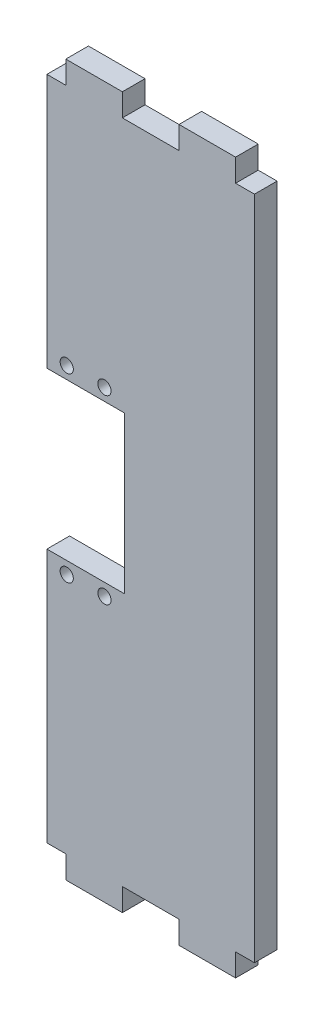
ISO-10303-21;
HEADER;
FILE_DESCRIPTION(('STEP AP214'),'2;1');
FILE_NAME('part.step','',(''),(''),'','','');
FILE_SCHEMA(('AUTOMOTIVE_DESIGN { 1 0 10303 214 1 1 1 1 }'));
ENDSEC;
DATA;
#1=APPLICATION_CONTEXT('core data for automotive mechanical design processes');
#2=APPLICATION_PROTOCOL_DEFINITION('international standard','automotive_design',2000,#1);
#3=PRODUCT_CONTEXT('',#1,'mechanical');
#4=PRODUCT('Part','Part','',(#3));
#5=PRODUCT_RELATED_PRODUCT_CATEGORY('part','',(#4));
#6=PRODUCT_DEFINITION_FORMATION('','',#4);
#7=PRODUCT_DEFINITION_CONTEXT('part definition',#1,'design');
#8=PRODUCT_DEFINITION('design','',#6,#7);
#9=PRODUCT_DEFINITION_SHAPE('','',#8);
#10=(LENGTH_UNIT() NAMED_UNIT(*) SI_UNIT(.MILLI.,.METRE.));
#11=(NAMED_UNIT(*) PLANE_ANGLE_UNIT() SI_UNIT($,.RADIAN.));
#12=(NAMED_UNIT(*) SI_UNIT($,.STERADIAN.) SOLID_ANGLE_UNIT());
#13=UNCERTAINTY_MEASURE_WITH_UNIT(LENGTH_MEASURE(1.E-05),#10,'distance_accuracy_value','');
#14=(GEOMETRIC_REPRESENTATION_CONTEXT(3) GLOBAL_UNCERTAINTY_ASSIGNED_CONTEXT((#13)) GLOBAL_UNIT_ASSIGNED_CONTEXT((#10,
#11,#12)) REPRESENTATION_CONTEXT('',''));
#15=CARTESIAN_POINT('',(0.,0.,0.));
#16=DIRECTION('',(0.,0.,1.));
#17=DIRECTION('',(1.,0.,0.));
#18=AXIS2_PLACEMENT_3D('',#15,#16,#17);
#19=CARTESIAN_POINT('',(-27.5,-88.2,6.));
#20=DIRECTION('',(1.,0.,0.));
#21=DIRECTION('',(0.,0.,-1.));
#22=AXIS2_PLACEMENT_3D('',#19,#20,#21);
#23=PLANE('',#22);
#24=DIRECTION('',(0.,-1.,0.));
#25=VECTOR('',#24,1.);
#26=CARTESIAN_POINT('',(-27.5,-88.2,0.));
#27=LINE('',#26,#25);
#28=CARTESIAN_POINT('',(-27.5,88.2,0.));
#29=VERTEX_POINT('',#28);
#30=CARTESIAN_POINT('',(-27.5,20.75,0.));
#31=VERTEX_POINT('',#30);
#32=EDGE_CURVE('E221',#29,#31,#27,.T.);
#33=ORIENTED_EDGE('',*,*,#32,.T.);
#34=DIRECTION('',(0.,0.,1.));
#35=VECTOR('',#34,1.);
#36=CARTESIAN_POINT('',(-27.5,20.75,0.));
#37=LINE('',#36,#35);
#38=CARTESIAN_POINT('',(-27.5,20.75,6.));
#39=VERTEX_POINT('',#38);
#40=EDGE_CURVE('E261',#31,#39,#37,.T.);
#41=ORIENTED_EDGE('',*,*,#40,.T.);
#42=DIRECTION('',(0.,-1.,0.));
#43=VECTOR('',#42,1.);
#44=CARTESIAN_POINT('',(-27.5,-88.2,6.));
#45=LINE('',#44,#43);
#46=CARTESIAN_POINT('',(-27.5,88.2,6.));
#47=VERTEX_POINT('',#46);
#48=EDGE_CURVE('E246',#47,#39,#45,.T.);
#49=ORIENTED_EDGE('',*,*,#48,.F.);
#50=DIRECTION('',(0.,0.,-1.));
#51=VECTOR('',#50,1.);
#52=CARTESIAN_POINT('',(-27.5,88.2,6.));
#53=LINE('',#52,#51);
#54=EDGE_CURVE('E43',#47,#29,#53,.T.);
#55=ORIENTED_EDGE('',*,*,#54,.T.);
#56=EDGE_LOOP('',(#33,#41,#49,#55));
#57=FACE_BOUND('',#56,.T.);
#58=ADVANCED_FACE('F35',(#57),#23,.F.);
#59=CARTESIAN_POINT('',(-27.5,88.2,6.));
#60=DIRECTION('',(0.,-1.,0.));
#61=DIRECTION('',(0.,0.,-1.));
#62=AXIS2_PLACEMENT_3D('',#59,#60,#61);
#63=PLANE('',#62);
#64=DIRECTION('',(-1.,0.,0.));
#65=VECTOR('',#64,1.);
#66=CARTESIAN_POINT('',(-27.5,88.2,6.));
#67=LINE('',#66,#65);
#68=CARTESIAN_POINT('',(7.5,88.2,6.));
#69=VERTEX_POINT('',#68);
#70=CARTESIAN_POINT('',(-7.5,88.2,6.));
#71=VERTEX_POINT('',#70);
#72=EDGE_CURVE('E372',#69,#71,#67,.T.);
#73=ORIENTED_EDGE('',*,*,#72,.F.);
#74=DIRECTION('',(0.,0.,-1.));
#75=VECTOR('',#74,1.);
#76=CARTESIAN_POINT('',(7.5,88.2,6.));
#77=LINE('',#76,#75);
#78=CARTESIAN_POINT('',(7.5,88.2,0.));
#79=VERTEX_POINT('',#78);
#80=EDGE_CURVE('E312',#69,#79,#77,.T.);
#81=ORIENTED_EDGE('',*,*,#80,.T.);
#82=DIRECTION('',(-1.,0.,0.));
#83=VECTOR('',#82,1.);
#84=CARTESIAN_POINT('',(-27.5,88.2,0.));
#85=LINE('',#84,#83);
#86=CARTESIAN_POINT('',(-7.5,88.2,0.));
#87=VERTEX_POINT('',#86);
#88=EDGE_CURVE('E226',#79,#87,#85,.T.);
#89=ORIENTED_EDGE('',*,*,#88,.T.);
#90=DIRECTION('',(0.,0.,1.));
#91=VECTOR('',#90,1.);
#92=CARTESIAN_POINT('',(-7.5,88.2,6.));
#93=LINE('',#92,#91);
#94=EDGE_CURVE('E358',#87,#71,#93,.T.);
#95=ORIENTED_EDGE('',*,*,#94,.T.);
#96=EDGE_LOOP('',(#73,#81,#89,#95));
#97=FACE_BOUND('',#96,.T.);
#98=ADVANCED_FACE('F382',(#97),#63,.F.);
#99=CARTESIAN_POINT('',(-27.5,-88.2,6.));
#100=DIRECTION('',(0.,1.,0.));
#101=DIRECTION('',(0.,0.,1.));
#102=AXIS2_PLACEMENT_3D('',#99,#100,#101);
#103=PLANE('',#102);
#104=DIRECTION('',(1.,0.,0.));
#105=VECTOR('',#104,1.);
#106=CARTESIAN_POINT('',(-27.5,-88.2,0.));
#107=LINE('',#106,#105);
#108=CARTESIAN_POINT('',(-7.5,-88.2,0.));
#109=VERTEX_POINT('',#108);
#110=CARTESIAN_POINT('',(7.5,-88.2,0.));
#111=VERTEX_POINT('',#110);
#112=EDGE_CURVE('E233',#109,#111,#107,.T.);
#113=ORIENTED_EDGE('',*,*,#112,.T.);
#114=DIRECTION('',(0.,0.,1.));
#115=VECTOR('',#114,1.);
#116=CARTESIAN_POINT('',(7.5,-88.2,6.));
#117=LINE('',#116,#115);
#118=CARTESIAN_POINT('',(7.5,-88.2,6.));
#119=VERTEX_POINT('',#118);
#120=EDGE_CURVE('E310',#111,#119,#117,.T.);
#121=ORIENTED_EDGE('',*,*,#120,.T.);
#122=DIRECTION('',(1.,0.,0.));
#123=VECTOR('',#122,1.);
#124=CARTESIAN_POINT('',(-27.5,-88.2,6.));
#125=LINE('',#124,#123);
#126=CARTESIAN_POINT('',(-7.5,-88.2,6.));
#127=VERTEX_POINT('',#126);
#128=EDGE_CURVE('E375',#127,#119,#125,.T.);
#129=ORIENTED_EDGE('',*,*,#128,.F.);
#130=DIRECTION('',(0.,0.,-1.));
#131=VECTOR('',#130,1.);
#132=CARTESIAN_POINT('',(-7.5,-88.2,6.));
#133=LINE('',#132,#131);
#134=EDGE_CURVE('E343',#127,#109,#133,.T.);
#135=ORIENTED_EDGE('',*,*,#134,.T.);
#136=EDGE_LOOP('',(#113,#121,#129,#135));
#137=FACE_BOUND('',#136,.T.);
#138=ADVANCED_FACE('F417',(#137),#103,.F.);
#139=CARTESIAN_POINT('',(-22.5,88.2,6.));
#140=VERTEX_POINT('',#139);
#141=EDGE_CURVE('E368',#140,#47,#67,.T.);
#142=ORIENTED_EDGE('',*,*,#141,.F.);
#143=DIRECTION('',(0.,0.,-1.));
#144=VECTOR('',#143,1.);
#145=CARTESIAN_POINT('',(-22.5,88.2,6.));
#146=LINE('',#145,#144);
#147=CARTESIAN_POINT('',(-22.5,88.2,0.));
#148=VERTEX_POINT('',#147);
#149=EDGE_CURVE('E363',#140,#148,#146,.T.);
#150=ORIENTED_EDGE('',*,*,#149,.T.);
#151=EDGE_CURVE('E228',#148,#29,#85,.T.);
#152=ORIENTED_EDGE('',*,*,#151,.T.);
#153=ORIENTED_EDGE('',*,*,#54,.F.);
#154=EDGE_LOOP('',(#142,#150,#152,#153));
#155=FACE_BOUND('',#154,.T.);
#156=ADVANCED_FACE('F467',(#155),#63,.F.);
#157=CARTESIAN_POINT('',(-27.5,-88.2,0.));
#158=VERTEX_POINT('',#157);
#159=CARTESIAN_POINT('',(-22.5,-88.2,0.));
#160=VERTEX_POINT('',#159);
#161=EDGE_CURVE('E220',#158,#160,#107,.T.);
#162=ORIENTED_EDGE('',*,*,#161,.T.);
#163=DIRECTION('',(0.,0.,1.));
#164=VECTOR('',#163,1.);
#165=CARTESIAN_POINT('',(-22.5,-88.2,6.));
#166=LINE('',#165,#164);
#167=CARTESIAN_POINT('',(-22.5,-88.2,6.));
#168=VERTEX_POINT('',#167);
#169=EDGE_CURVE('E361',#160,#168,#166,.T.);
#170=ORIENTED_EDGE('',*,*,#169,.T.);
#171=CARTESIAN_POINT('',(-27.5,-88.2,6.));
#172=VERTEX_POINT('',#171);
#173=EDGE_CURVE('E238',#172,#168,#125,.T.);
#174=ORIENTED_EDGE('',*,*,#173,.F.);
#175=DIRECTION('',(0.,0.,-1.));
#176=VECTOR('',#175,1.);
#177=CARTESIAN_POINT('',(-27.5,-88.2,6.));
#178=LINE('',#177,#176);
#179=EDGE_CURVE('E237',#172,#158,#178,.T.);
#180=ORIENTED_EDGE('',*,*,#179,.T.);
#181=EDGE_LOOP('',(#162,#170,#174,#180));
#182=FACE_BOUND('',#181,.T.);
#183=ADVANCED_FACE('F445',(#182),#103,.F.);
#184=CARTESIAN_POINT('',(27.5,-88.2,6.));
#185=DIRECTION('',(-1.,0.,0.));
#186=DIRECTION('',(0.,0.,1.));
#187=AXIS2_PLACEMENT_3D('',#184,#185,#186);
#188=PLANE('',#187);
#189=DIRECTION('',(0.,1.,0.));
#190=VECTOR('',#189,1.);
#191=CARTESIAN_POINT('',(27.5,-88.2,0.));
#192=LINE('',#191,#190);
#193=CARTESIAN_POINT('',(27.5,-88.2,0.));
#194=VERTEX_POINT('',#193);
#195=CARTESIAN_POINT('',(27.5,88.2,0.));
#196=VERTEX_POINT('',#195);
#197=EDGE_CURVE('E365',#194,#196,#192,.T.);
#198=ORIENTED_EDGE('',*,*,#197,.T.);
#199=DIRECTION('',(0.,0.,-1.));
#200=VECTOR('',#199,1.);
#201=CARTESIAN_POINT('',(27.5,88.2,6.));
#202=LINE('',#201,#200);
#203=CARTESIAN_POINT('',(27.5,88.2,6.));
#204=VERTEX_POINT('',#203);
#205=EDGE_CURVE('E11',#204,#196,#202,.T.);
#206=ORIENTED_EDGE('',*,*,#205,.F.);
#207=DIRECTION('',(0.,1.,0.));
#208=VECTOR('',#207,1.);
#209=CARTESIAN_POINT('',(27.5,-88.2,6.));
#210=LINE('',#209,#208);
#211=CARTESIAN_POINT('',(27.5,-88.2,6.));
#212=VERTEX_POINT('',#211);
#213=EDGE_CURVE('E232',#212,#204,#210,.T.);
#214=ORIENTED_EDGE('',*,*,#213,.F.);
#215=DIRECTION('',(0.,0.,-1.));
#216=VECTOR('',#215,1.);
#217=CARTESIAN_POINT('',(27.5,-88.2,6.));
#218=LINE('',#217,#216);
#219=EDGE_CURVE('E234',#212,#194,#218,.T.);
#220=ORIENTED_EDGE('',*,*,#219,.T.);
#221=EDGE_LOOP('',(#198,#206,#214,#220));
#222=FACE_BOUND('',#221,.T.);
#223=ADVANCED_FACE('F37',(#222),#188,.F.);
#224=CARTESIAN_POINT('',(22.5,88.2,0.));
#225=VERTEX_POINT('',#224);
#226=EDGE_CURVE('E222',#196,#225,#85,.T.);
#227=ORIENTED_EDGE('',*,*,#226,.T.);
#228=DIRECTION('',(0.,0.,1.));
#229=VECTOR('',#228,1.);
#230=CARTESIAN_POINT('',(22.5,88.2,6.));
#231=LINE('',#230,#229);
#232=CARTESIAN_POINT('',(22.5,88.2,6.));
#233=VERTEX_POINT('',#232);
#234=EDGE_CURVE('E308',#225,#233,#231,.T.);
#235=ORIENTED_EDGE('',*,*,#234,.T.);
#236=EDGE_CURVE('E369',#204,#233,#67,.T.);
#237=ORIENTED_EDGE('',*,*,#236,.F.);
#238=ORIENTED_EDGE('',*,*,#205,.T.);
#239=EDGE_LOOP('',(#227,#235,#237,#238));
#240=FACE_BOUND('',#239,.T.);
#241=ADVANCED_FACE('F409',(#240),#63,.F.);
#242=CARTESIAN_POINT('',(-27.5,-20.75,6.));
#243=VERTEX_POINT('',#242);
#244=EDGE_CURVE('E213',#243,#172,#45,.T.);
#245=ORIENTED_EDGE('',*,*,#244,.F.);
#246=DIRECTION('',(0.,0.,1.));
#247=VECTOR('',#246,1.);
#248=CARTESIAN_POINT('',(-27.5,-20.75,0.));
#249=LINE('',#248,#247);
#250=CARTESIAN_POINT('',(-27.5,-20.75,0.));
#251=VERTEX_POINT('',#250);
#252=EDGE_CURVE('E200',#251,#243,#249,.T.);
#253=ORIENTED_EDGE('',*,*,#252,.F.);
#254=EDGE_CURVE('E211',#251,#158,#27,.T.);
#255=ORIENTED_EDGE('',*,*,#254,.T.);
#256=ORIENTED_EDGE('',*,*,#179,.F.);
#257=EDGE_LOOP('',(#245,#253,#255,#256));
#258=FACE_BOUND('',#257,.T.);
#259=ADVANCED_FACE('F209',(#258),#23,.F.);
#260=CARTESIAN_POINT('',(22.5,-88.2,6.));
#261=VERTEX_POINT('',#260);
#262=EDGE_CURVE('E58',#261,#212,#125,.T.);
#263=ORIENTED_EDGE('',*,*,#262,.F.);
#264=DIRECTION('',(0.,0.,-1.));
#265=VECTOR('',#264,1.);
#266=CARTESIAN_POINT('',(22.5,-88.2,6.));
#267=LINE('',#266,#265);
#268=CARTESIAN_POINT('',(22.5,-88.2,0.));
#269=VERTEX_POINT('',#268);
#270=EDGE_CURVE('E294',#261,#269,#267,.T.);
#271=ORIENTED_EDGE('',*,*,#270,.T.);
#272=EDGE_CURVE('E225',#269,#194,#107,.T.);
#273=ORIENTED_EDGE('',*,*,#272,.T.);
#274=ORIENTED_EDGE('',*,*,#219,.F.);
#275=EDGE_LOOP('',(#263,#271,#273,#274));
#276=FACE_BOUND('',#275,.T.);
#277=ADVANCED_FACE('F413',(#276),#103,.F.);
#278=CARTESIAN_POINT('',(0.,0.,6.));
#279=DIRECTION('',(0.,0.,-1.));
#280=DIRECTION('',(-1.,0.,0.));
#281=AXIS2_PLACEMENT_3D('',#278,#279,#280);
#282=PLANE('',#281);
#283=CARTESIAN_POINT('',(-22.25,-24.,6.));
#284=DIRECTION('',(0.,0.,1.));
#285=DIRECTION('',(-1.,0.,0.));
#286=AXIS2_PLACEMENT_3D('',#283,#284,#285);
#287=CIRCLE('',#286,1.74999999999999);
#288=CARTESIAN_POINT('',(-20.5,-24.,6.));
#289=VERTEX_POINT('',#288);
#290=EDGE_CURVE('E535',#289,#289,#287,.T.);
#291=ORIENTED_EDGE('',*,*,#290,.F.);
#292=EDGE_LOOP('',(#291));
#293=FACE_BOUND('',#292,.T.);
#294=CARTESIAN_POINT('',(-12.25,-24.,6.));
#295=DIRECTION('',(0.,0.,1.));
#296=DIRECTION('',(1.,0.,0.));
#297=AXIS2_PLACEMENT_3D('',#294,#295,#296);
#298=CIRCLE('',#297,1.75);
#299=CARTESIAN_POINT('',(-10.5,-24.,6.));
#300=VERTEX_POINT('',#299);
#301=EDGE_CURVE('E540',#300,#300,#298,.T.);
#302=ORIENTED_EDGE('',*,*,#301,.F.);
#303=EDGE_LOOP('',(#302));
#304=FACE_BOUND('',#303,.T.);
#305=CARTESIAN_POINT('',(-12.25,24.,6.));
#306=DIRECTION('',(0.,0.,1.));
#307=DIRECTION('',(-1.,0.,0.));
#308=AXIS2_PLACEMENT_3D('',#305,#306,#307);
#309=CIRCLE('',#308,1.75);
#310=CARTESIAN_POINT('',(-10.5,24.,6.));
#311=VERTEX_POINT('',#310);
#312=EDGE_CURVE('E548',#311,#311,#309,.T.);
#313=ORIENTED_EDGE('',*,*,#312,.F.);
#314=EDGE_LOOP('',(#313));
#315=FACE_BOUND('',#314,.T.);
#316=CARTESIAN_POINT('',(-22.25,24.,6.));
#317=DIRECTION('',(0.,0.,1.));
#318=DIRECTION('',(1.,0.,0.));
#319=AXIS2_PLACEMENT_3D('',#316,#317,#318);
#320=CIRCLE('',#319,1.75);
#321=CARTESIAN_POINT('',(-20.5,24.,6.));
#322=VERTEX_POINT('',#321);
#323=EDGE_CURVE('E257',#322,#322,#320,.T.);
#324=ORIENTED_EDGE('',*,*,#323,.F.);
#325=EDGE_LOOP('',(#324));
#326=FACE_BOUND('',#325,.T.);
#327=ORIENTED_EDGE('',*,*,#48,.T.);
#328=DIRECTION('',(-1.,0.,0.));
#329=VECTOR('',#328,1.);
#330=CARTESIAN_POINT('',(-7.00000000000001,20.75,6.));
#331=LINE('',#330,#329);
#332=CARTESIAN_POINT('',(-7.00000000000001,20.75,6.));
#333=VERTEX_POINT('',#332);
#334=EDGE_CURVE('E205',#333,#39,#331,.T.);
#335=ORIENTED_EDGE('',*,*,#334,.F.);
#336=DIRECTION('',(0.,1.,0.));
#337=VECTOR('',#336,1.);
#338=CARTESIAN_POINT('',(-7.00000000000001,-20.75,6.));
#339=LINE('',#338,#337);
#340=CARTESIAN_POINT('',(-7.00000000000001,-20.75,6.));
#341=VERTEX_POINT('',#340);
#342=EDGE_CURVE('E256',#341,#333,#339,.T.);
#343=ORIENTED_EDGE('',*,*,#342,.F.);
#344=DIRECTION('',(1.,0.,0.));
#345=VECTOR('',#344,1.);
#346=CARTESIAN_POINT('',(-7.00000000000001,-20.75,6.));
#347=LINE('',#346,#345);
#348=EDGE_CURVE('E254',#243,#341,#347,.T.);
#349=ORIENTED_EDGE('',*,*,#348,.F.);
#350=ORIENTED_EDGE('',*,*,#244,.T.);
#351=ORIENTED_EDGE('',*,*,#173,.T.);
#352=DIRECTION('',(0.,-1.,0.));
#353=VECTOR('',#352,1.);
#354=CARTESIAN_POINT('',(-22.5,94.2,6.));
#355=LINE('',#354,#353);
#356=CARTESIAN_POINT('',(-22.5,-94.2,6.));
#357=VERTEX_POINT('',#356);
#358=EDGE_CURVE('E344',#168,#357,#355,.T.);
#359=ORIENTED_EDGE('',*,*,#358,.T.);
#360=DIRECTION('',(-1.,0.,0.));
#361=VECTOR('',#360,1.);
#362=CARTESIAN_POINT('',(-22.5,-94.2,6.));
#363=LINE('',#362,#361);
#364=CARTESIAN_POINT('',(-7.5,-94.2,6.));
#365=VERTEX_POINT('',#364);
#366=EDGE_CURVE('E324',#365,#357,#363,.T.);
#367=ORIENTED_EDGE('',*,*,#366,.F.);
#368=DIRECTION('',(0.,-1.,0.));
#369=VECTOR('',#368,1.);
#370=CARTESIAN_POINT('',(-7.5,94.2,6.));
#371=LINE('',#370,#369);
#372=EDGE_CURVE('E348',#127,#365,#371,.T.);
#373=ORIENTED_EDGE('',*,*,#372,.F.);
#374=ORIENTED_EDGE('',*,*,#128,.T.);
#375=DIRECTION('',(0.,-1.,0.));
#376=VECTOR('',#375,1.);
#377=CARTESIAN_POINT('',(7.5,94.2,6.));
#378=LINE('',#377,#376);
#379=CARTESIAN_POINT('',(7.5,-94.2,6.));
#380=VERTEX_POINT('',#379);
#381=EDGE_CURVE('E295',#119,#380,#378,.T.);
#382=ORIENTED_EDGE('',*,*,#381,.T.);
#383=DIRECTION('',(-1.,0.,0.));
#384=VECTOR('',#383,1.);
#385=CARTESIAN_POINT('',(7.5,-94.2,6.));
#386=LINE('',#385,#384);
#387=CARTESIAN_POINT('',(22.5,-94.2,6.));
#388=VERTEX_POINT('',#387);
#389=EDGE_CURVE('E275',#388,#380,#386,.T.);
#390=ORIENTED_EDGE('',*,*,#389,.F.);
#391=DIRECTION('',(0.,-1.,0.));
#392=VECTOR('',#391,1.);
#393=CARTESIAN_POINT('',(22.5,94.2,6.));
#394=LINE('',#393,#392);
#395=EDGE_CURVE('E299',#261,#388,#394,.T.);
#396=ORIENTED_EDGE('',*,*,#395,.F.);
#397=ORIENTED_EDGE('',*,*,#262,.T.);
#398=ORIENTED_EDGE('',*,*,#213,.T.);
#399=ORIENTED_EDGE('',*,*,#236,.T.);
#400=CARTESIAN_POINT('',(22.5,94.2,6.));
#401=VERTEX_POINT('',#400);
#402=EDGE_CURVE('E296',#401,#233,#394,.T.);
#403=ORIENTED_EDGE('',*,*,#402,.F.);
#404=DIRECTION('',(-1.,0.,0.));
#405=VECTOR('',#404,1.);
#406=CARTESIAN_POINT('',(7.5,94.2,6.));
#407=LINE('',#406,#405);
#408=CARTESIAN_POINT('',(7.5,94.2,6.));
#409=VERTEX_POINT('',#408);
#410=EDGE_CURVE('E287',#401,#409,#407,.T.);
#411=ORIENTED_EDGE('',*,*,#410,.T.);
#412=EDGE_CURVE('E291',#409,#69,#378,.T.);
#413=ORIENTED_EDGE('',*,*,#412,.T.);
#414=ORIENTED_EDGE('',*,*,#72,.T.);
#415=CARTESIAN_POINT('',(-7.5,94.2,6.));
#416=VERTEX_POINT('',#415);
#417=EDGE_CURVE('E345',#416,#71,#371,.T.);
#418=ORIENTED_EDGE('',*,*,#417,.F.);
#419=DIRECTION('',(-1.,0.,0.));
#420=VECTOR('',#419,1.);
#421=CARTESIAN_POINT('',(-22.5,94.2,6.));
#422=LINE('',#421,#420);
#423=CARTESIAN_POINT('',(-22.5,94.2,6.));
#424=VERTEX_POINT('',#423);
#425=EDGE_CURVE('E336',#416,#424,#422,.T.);
#426=ORIENTED_EDGE('',*,*,#425,.T.);
#427=EDGE_CURVE('E340',#424,#140,#355,.T.);
#428=ORIENTED_EDGE('',*,*,#427,.T.);
#429=ORIENTED_EDGE('',*,*,#141,.T.);
#430=EDGE_LOOP('',(#327,#335,#343,#349,#350,#351,#359,#367,#373,#374,#382,#390,#396,#397,#398,
#399,#403,#411,#413,#414,#418,#426,#428,#429));
#431=FACE_BOUND('',#430,.T.);
#432=ADVANCED_FACE('F396',(#293,#304,#315,#326,#431),#282,.F.);
#433=CARTESIAN_POINT('',(0.,0.,0.));
#434=DIRECTION('',(0.,0.,-1.));
#435=DIRECTION('',(-1.,0.,0.));
#436=AXIS2_PLACEMENT_3D('',#433,#434,#435);
#437=PLANE('',#436);
#438=CARTESIAN_POINT('',(-22.25,-24.,0.));
#439=DIRECTION('',(0.,0.,-1.));
#440=DIRECTION('',(-1.,0.,0.));
#441=AXIS2_PLACEMENT_3D('',#438,#439,#440);
#442=CIRCLE('',#441,1.74999999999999);
#443=CARTESIAN_POINT('',(-20.5,-24.,0.));
#444=VERTEX_POINT('',#443);
#445=EDGE_CURVE('E532',#444,#444,#442,.F.);
#446=ORIENTED_EDGE('',*,*,#445,.T.);
#447=EDGE_LOOP('',(#446));
#448=FACE_BOUND('',#447,.T.);
#449=CARTESIAN_POINT('',(-12.25,-24.,0.));
#450=DIRECTION('',(0.,0.,-1.));
#451=DIRECTION('',(-1.,0.,0.));
#452=AXIS2_PLACEMENT_3D('',#449,#450,#451);
#453=CIRCLE('',#452,1.75);
#454=CARTESIAN_POINT('',(-10.5,-24.,0.));
#455=VERTEX_POINT('',#454);
#456=EDGE_CURVE('E545',#455,#455,#453,.F.);
#457=ORIENTED_EDGE('',*,*,#456,.T.);
#458=EDGE_LOOP('',(#457));
#459=FACE_BOUND('',#458,.T.);
#460=CARTESIAN_POINT('',(-12.25,24.,0.));
#461=DIRECTION('',(0.,0.,-1.));
#462=DIRECTION('',(-1.,0.,0.));
#463=AXIS2_PLACEMENT_3D('',#460,#461,#462);
#464=CIRCLE('',#463,1.75);
#465=CARTESIAN_POINT('',(-10.5,24.,0.));
#466=VERTEX_POINT('',#465);
#467=EDGE_CURVE('E551',#466,#466,#464,.F.);
#468=ORIENTED_EDGE('',*,*,#467,.T.);
#469=EDGE_LOOP('',(#468));
#470=FACE_BOUND('',#469,.T.);
#471=CARTESIAN_POINT('',(-22.25,24.,0.));
#472=DIRECTION('',(0.,0.,-1.));
#473=DIRECTION('',(-1.,0.,0.));
#474=AXIS2_PLACEMENT_3D('',#471,#472,#473);
#475=CIRCLE('',#474,1.75);
#476=CARTESIAN_POINT('',(-20.5,24.,0.));
#477=VERTEX_POINT('',#476);
#478=EDGE_CURVE('E536',#477,#477,#475,.F.);
#479=ORIENTED_EDGE('',*,*,#478,.T.);
#480=EDGE_LOOP('',(#479));
#481=FACE_BOUND('',#480,.T.);
#482=DIRECTION('',(-1.,0.,0.));
#483=VECTOR('',#482,1.);
#484=CARTESIAN_POINT('',(-7.00000000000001,20.75,0.));
#485=LINE('',#484,#483);
#486=CARTESIAN_POINT('',(-7.00000000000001,20.75,0.));
#487=VERTEX_POINT('',#486);
#488=EDGE_CURVE('E214',#487,#31,#485,.T.);
#489=ORIENTED_EDGE('',*,*,#488,.T.);
#490=ORIENTED_EDGE('',*,*,#32,.F.);
#491=ORIENTED_EDGE('',*,*,#151,.F.);
#492=DIRECTION('',(0.,-1.,0.));
#493=VECTOR('',#492,1.);
#494=CARTESIAN_POINT('',(-22.5,94.2,0.));
#495=LINE('',#494,#493);
#496=CARTESIAN_POINT('',(-22.5,94.2,0.));
#497=VERTEX_POINT('',#496);
#498=EDGE_CURVE('E353',#497,#148,#495,.T.);
#499=ORIENTED_EDGE('',*,*,#498,.F.);
#500=DIRECTION('',(1.,0.,0.));
#501=VECTOR('',#500,1.);
#502=CARTESIAN_POINT('',(-22.5,94.2,0.));
#503=LINE('',#502,#501);
#504=CARTESIAN_POINT('',(-7.5,94.2,0.));
#505=VERTEX_POINT('',#504);
#506=EDGE_CURVE('E330',#497,#505,#503,.T.);
#507=ORIENTED_EDGE('',*,*,#506,.T.);
#508=DIRECTION('',(0.,-1.,0.));
#509=VECTOR('',#508,1.);
#510=CARTESIAN_POINT('',(-7.5,94.2,0.));
#511=LINE('',#510,#509);
#512=EDGE_CURVE('E349',#505,#87,#511,.T.);
#513=ORIENTED_EDGE('',*,*,#512,.T.);
#514=ORIENTED_EDGE('',*,*,#88,.F.);
#515=DIRECTION('',(0.,-1.,0.));
#516=VECTOR('',#515,1.);
#517=CARTESIAN_POINT('',(7.5,94.2,0.));
#518=LINE('',#517,#516);
#519=CARTESIAN_POINT('',(7.5,94.2,0.));
#520=VERTEX_POINT('',#519);
#521=EDGE_CURVE('E304',#520,#79,#518,.T.);
#522=ORIENTED_EDGE('',*,*,#521,.F.);
#523=DIRECTION('',(1.,0.,0.));
#524=VECTOR('',#523,1.);
#525=CARTESIAN_POINT('',(7.5,94.2,0.));
#526=LINE('',#525,#524);
#527=CARTESIAN_POINT('',(22.5,94.2,0.));
#528=VERTEX_POINT('',#527);
#529=EDGE_CURVE('E281',#520,#528,#526,.T.);
#530=ORIENTED_EDGE('',*,*,#529,.T.);
#531=DIRECTION('',(0.,-1.,0.));
#532=VECTOR('',#531,1.);
#533=CARTESIAN_POINT('',(22.5,94.2,0.));
#534=LINE('',#533,#532);
#535=EDGE_CURVE('E300',#528,#225,#534,.T.);
#536=ORIENTED_EDGE('',*,*,#535,.T.);
#537=ORIENTED_EDGE('',*,*,#226,.F.);
#538=ORIENTED_EDGE('',*,*,#197,.F.);
#539=ORIENTED_EDGE('',*,*,#272,.F.);
#540=CARTESIAN_POINT('',(22.5,-94.2,0.));
#541=VERTEX_POINT('',#540);
#542=EDGE_CURVE('E303',#269,#541,#534,.T.);
#543=ORIENTED_EDGE('',*,*,#542,.T.);
#544=DIRECTION('',(1.,0.,0.));
#545=VECTOR('',#544,1.);
#546=CARTESIAN_POINT('',(7.5,-94.2,0.));
#547=LINE('',#546,#545);
#548=CARTESIAN_POINT('',(7.5,-94.2,0.));
#549=VERTEX_POINT('',#548);
#550=EDGE_CURVE('E269',#549,#541,#547,.T.);
#551=ORIENTED_EDGE('',*,*,#550,.F.);
#552=EDGE_CURVE('E290',#111,#549,#518,.T.);
#553=ORIENTED_EDGE('',*,*,#552,.F.);
#554=ORIENTED_EDGE('',*,*,#112,.F.);
#555=CARTESIAN_POINT('',(-7.5,-94.2,0.));
#556=VERTEX_POINT('',#555);
#557=EDGE_CURVE('E352',#109,#556,#511,.T.);
#558=ORIENTED_EDGE('',*,*,#557,.T.);
#559=DIRECTION('',(1.,0.,0.));
#560=VECTOR('',#559,1.);
#561=CARTESIAN_POINT('',(-22.5,-94.2,0.));
#562=LINE('',#561,#560);
#563=CARTESIAN_POINT('',(-22.5,-94.2,0.));
#564=VERTEX_POINT('',#563);
#565=EDGE_CURVE('E318',#564,#556,#562,.T.);
#566=ORIENTED_EDGE('',*,*,#565,.F.);
#567=EDGE_CURVE('E339',#160,#564,#495,.T.);
#568=ORIENTED_EDGE('',*,*,#567,.F.);
#569=ORIENTED_EDGE('',*,*,#161,.F.);
#570=ORIENTED_EDGE('',*,*,#254,.F.);
#571=DIRECTION('',(1.,0.,0.));
#572=VECTOR('',#571,1.);
#573=CARTESIAN_POINT('',(-7.00000000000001,-20.75,0.));
#574=LINE('',#573,#572);
#575=CARTESIAN_POINT('',(-7.00000000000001,-20.75,0.));
#576=VERTEX_POINT('',#575);
#577=EDGE_CURVE('E196',#251,#576,#574,.T.);
#578=ORIENTED_EDGE('',*,*,#577,.T.);
#579=DIRECTION('',(0.,1.,0.));
#580=VECTOR('',#579,1.);
#581=CARTESIAN_POINT('',(-7.00000000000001,-20.75,0.));
#582=LINE('',#581,#580);
#583=EDGE_CURVE('E50',#576,#487,#582,.T.);
#584=ORIENTED_EDGE('',*,*,#583,.T.);
#585=EDGE_LOOP('',(#489,#490,#491,#499,#507,#513,#514,#522,#530,#536,#537,#538,#539,#543,#551,
#553,#554,#558,#566,#568,#569,#570,#578,#584));
#586=FACE_BOUND('',#585,.T.);
#587=ADVANCED_FACE('F218',(#448,#459,#470,#481,#586),#437,.T.);
#588=CARTESIAN_POINT('',(0.,-94.2,0.));
#589=DIRECTION('',(0.,-1.,0.));
#590=DIRECTION('',(0.,0.,-1.));
#591=AXIS2_PLACEMENT_3D('',#588,#589,#590);
#592=PLANE('',#591);
#593=DIRECTION('',(0.,0.,-1.));
#594=VECTOR('',#593,1.);
#595=CARTESIAN_POINT('',(-22.5,-94.2,6.));
#596=LINE('',#595,#594);
#597=EDGE_CURVE('E315',#357,#564,#596,.T.);
#598=ORIENTED_EDGE('',*,*,#597,.T.);
#599=ORIENTED_EDGE('',*,*,#565,.T.);
#600=DIRECTION('',(0.,0.,1.));
#601=VECTOR('',#600,1.);
#602=CARTESIAN_POINT('',(-7.5,-94.2,6.));
#603=LINE('',#602,#601);
#604=EDGE_CURVE('E321',#556,#365,#603,.T.);
#605=ORIENTED_EDGE('',*,*,#604,.T.);
#606=ORIENTED_EDGE('',*,*,#366,.T.);
#607=EDGE_LOOP('',(#598,#599,#605,#606));
#608=FACE_BOUND('',#607,.T.);
#609=ADVANCED_FACE('F437',(#608),#592,.T.);
#610=CARTESIAN_POINT('',(-7.5,94.2,6.));
#611=DIRECTION('',(1.,0.,0.));
#612=DIRECTION('',(0.,0.,-1.));
#613=AXIS2_PLACEMENT_3D('',#610,#611,#612);
#614=PLANE('',#613);
#615=ORIENTED_EDGE('',*,*,#134,.F.);
#616=ORIENTED_EDGE('',*,*,#372,.T.);
#617=ORIENTED_EDGE('',*,*,#604,.F.);
#618=ORIENTED_EDGE('',*,*,#557,.F.);
#619=EDGE_LOOP('',(#615,#616,#617,#618));
#620=FACE_BOUND('',#619,.T.);
#621=ADVANCED_FACE('F433',(#620),#614,.T.);
#622=CARTESIAN_POINT('',(-22.5,94.2,6.));
#623=DIRECTION('',(-1.,0.,0.));
#624=DIRECTION('',(0.,0.,1.));
#625=AXIS2_PLACEMENT_3D('',#622,#623,#624);
#626=PLANE('',#625);
#627=ORIENTED_EDGE('',*,*,#169,.F.);
#628=ORIENTED_EDGE('',*,*,#567,.T.);
#629=ORIENTED_EDGE('',*,*,#597,.F.);
#630=ORIENTED_EDGE('',*,*,#358,.F.);
#631=EDGE_LOOP('',(#627,#628,#629,#630));
#632=FACE_BOUND('',#631,.T.);
#633=ADVANCED_FACE('F442',(#632),#626,.T.);
#634=ORIENTED_EDGE('',*,*,#149,.F.);
#635=ORIENTED_EDGE('',*,*,#427,.F.);
#636=DIRECTION('',(0.,0.,-1.));
#637=VECTOR('',#636,1.);
#638=CARTESIAN_POINT('',(-22.5,94.2,6.));
#639=LINE('',#638,#637);
#640=EDGE_CURVE('E327',#424,#497,#639,.T.);
#641=ORIENTED_EDGE('',*,*,#640,.T.);
#642=ORIENTED_EDGE('',*,*,#498,.T.);
#643=EDGE_LOOP('',(#634,#635,#641,#642));
#644=FACE_BOUND('',#643,.T.);
#645=ADVANCED_FACE('F394',(#644),#626,.T.);
#646=ORIENTED_EDGE('',*,*,#94,.F.);
#647=ORIENTED_EDGE('',*,*,#512,.F.);
#648=DIRECTION('',(0.,0.,1.));
#649=VECTOR('',#648,1.);
#650=CARTESIAN_POINT('',(-7.5,94.2,6.));
#651=LINE('',#650,#649);
#652=EDGE_CURVE('E333',#505,#416,#651,.T.);
#653=ORIENTED_EDGE('',*,*,#652,.T.);
#654=ORIENTED_EDGE('',*,*,#417,.T.);
#655=EDGE_LOOP('',(#646,#647,#653,#654));
#656=FACE_BOUND('',#655,.T.);
#657=ADVANCED_FACE('F385',(#656),#614,.T.);
#658=CARTESIAN_POINT('',(0.,94.2,0.));
#659=DIRECTION('',(0.,-1.,0.));
#660=DIRECTION('',(0.,0.,-1.));
#661=AXIS2_PLACEMENT_3D('',#658,#659,#660);
#662=PLANE('',#661);
#663=ORIENTED_EDGE('',*,*,#640,.F.);
#664=ORIENTED_EDGE('',*,*,#425,.F.);
#665=ORIENTED_EDGE('',*,*,#652,.F.);
#666=ORIENTED_EDGE('',*,*,#506,.F.);
#667=EDGE_LOOP('',(#663,#664,#665,#666));
#668=FACE_BOUND('',#667,.T.);
#669=ADVANCED_FACE('F390',(#668),#662,.F.);
#670=CARTESIAN_POINT('',(0.,-94.2,0.));
#671=DIRECTION('',(0.,-1.,0.));
#672=DIRECTION('',(0.,0.,-1.));
#673=AXIS2_PLACEMENT_3D('',#670,#671,#672);
#674=PLANE('',#673);
#675=DIRECTION('',(0.,0.,-1.));
#676=VECTOR('',#675,1.);
#677=CARTESIAN_POINT('',(7.5,-94.2,6.));
#678=LINE('',#677,#676);
#679=EDGE_CURVE('E263',#380,#549,#678,.T.);
#680=ORIENTED_EDGE('',*,*,#679,.T.);
#681=ORIENTED_EDGE('',*,*,#550,.T.);
#682=DIRECTION('',(0.,0.,1.));
#683=VECTOR('',#682,1.);
#684=CARTESIAN_POINT('',(22.5,-94.2,6.));
#685=LINE('',#684,#683);
#686=EDGE_CURVE('E272',#541,#388,#685,.T.);
#687=ORIENTED_EDGE('',*,*,#686,.T.);
#688=ORIENTED_EDGE('',*,*,#389,.T.);
#689=EDGE_LOOP('',(#680,#681,#687,#688));
#690=FACE_BOUND('',#689,.T.);
#691=ADVANCED_FACE('F429',(#690),#674,.T.);
#692=CARTESIAN_POINT('',(22.5,94.2,6.));
#693=DIRECTION('',(1.,0.,0.));
#694=DIRECTION('',(0.,0.,-1.));
#695=AXIS2_PLACEMENT_3D('',#692,#693,#694);
#696=PLANE('',#695);
#697=ORIENTED_EDGE('',*,*,#270,.F.);
#698=ORIENTED_EDGE('',*,*,#395,.T.);
#699=ORIENTED_EDGE('',*,*,#686,.F.);
#700=ORIENTED_EDGE('',*,*,#542,.F.);
#701=EDGE_LOOP('',(#697,#698,#699,#700));
#702=FACE_BOUND('',#701,.T.);
#703=ADVANCED_FACE('F501',(#702),#696,.T.);
#704=CARTESIAN_POINT('',(7.5,94.2,6.));
#705=DIRECTION('',(-1.,0.,0.));
#706=DIRECTION('',(0.,0.,1.));
#707=AXIS2_PLACEMENT_3D('',#704,#705,#706);
#708=PLANE('',#707);
#709=ORIENTED_EDGE('',*,*,#120,.F.);
#710=ORIENTED_EDGE('',*,*,#552,.T.);
#711=ORIENTED_EDGE('',*,*,#679,.F.);
#712=ORIENTED_EDGE('',*,*,#381,.F.);
#713=EDGE_LOOP('',(#709,#710,#711,#712));
#714=FACE_BOUND('',#713,.T.);
#715=ADVANCED_FACE('F424',(#714),#708,.T.);
#716=ORIENTED_EDGE('',*,*,#80,.F.);
#717=ORIENTED_EDGE('',*,*,#412,.F.);
#718=DIRECTION('',(0.,0.,-1.));
#719=VECTOR('',#718,1.);
#720=CARTESIAN_POINT('',(7.5,94.2,6.));
#721=LINE('',#720,#719);
#722=EDGE_CURVE('E278',#409,#520,#721,.T.);
#723=ORIENTED_EDGE('',*,*,#722,.T.);
#724=ORIENTED_EDGE('',*,*,#521,.T.);
#725=EDGE_LOOP('',(#716,#717,#723,#724));
#726=FACE_BOUND('',#725,.T.);
#727=ADVANCED_FACE('F398',(#726),#708,.T.);
#728=ORIENTED_EDGE('',*,*,#234,.F.);
#729=ORIENTED_EDGE('',*,*,#535,.F.);
#730=DIRECTION('',(0.,0.,1.));
#731=VECTOR('',#730,1.);
#732=CARTESIAN_POINT('',(22.5,94.2,6.));
#733=LINE('',#732,#731);
#734=EDGE_CURVE('E284',#528,#401,#733,.T.);
#735=ORIENTED_EDGE('',*,*,#734,.T.);
#736=ORIENTED_EDGE('',*,*,#402,.T.);
#737=EDGE_LOOP('',(#728,#729,#735,#736));
#738=FACE_BOUND('',#737,.T.);
#739=ADVANCED_FACE('F407',(#738),#696,.T.);
#740=CARTESIAN_POINT('',(0.,94.2,0.));
#741=DIRECTION('',(0.,-1.,0.));
#742=DIRECTION('',(0.,0.,-1.));
#743=AXIS2_PLACEMENT_3D('',#740,#741,#742);
#744=PLANE('',#743);
#745=ORIENTED_EDGE('',*,*,#722,.F.);
#746=ORIENTED_EDGE('',*,*,#410,.F.);
#747=ORIENTED_EDGE('',*,*,#734,.F.);
#748=ORIENTED_EDGE('',*,*,#529,.F.);
#749=EDGE_LOOP('',(#745,#746,#747,#748));
#750=FACE_BOUND('',#749,.T.);
#751=ADVANCED_FACE('F403',(#750),#744,.F.);
#752=CARTESIAN_POINT('',(-7.00000000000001,20.75,0.));
#753=DIRECTION('',(0.,1.,0.));
#754=DIRECTION('',(0.,0.,1.));
#755=AXIS2_PLACEMENT_3D('',#752,#753,#754);
#756=PLANE('',#755);
#757=ORIENTED_EDGE('',*,*,#334,.T.);
#758=ORIENTED_EDGE('',*,*,#40,.F.);
#759=ORIENTED_EDGE('',*,*,#488,.F.);
#760=DIRECTION('',(0.,0.,1.));
#761=VECTOR('',#760,1.);
#762=CARTESIAN_POINT('',(-7.00000000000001,20.75,0.));
#763=LINE('',#762,#761);
#764=EDGE_CURVE('E264',#487,#333,#763,.T.);
#765=ORIENTED_EDGE('',*,*,#764,.T.);
#766=EDGE_LOOP('',(#757,#758,#759,#765));
#767=FACE_BOUND('',#766,.T.);
#768=ADVANCED_FACE('F449',(#767),#756,.F.);
#769=CARTESIAN_POINT('',(-7.00000000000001,-20.75,0.));
#770=DIRECTION('',(1.,0.,0.));
#771=DIRECTION('',(0.,0.,-1.));
#772=AXIS2_PLACEMENT_3D('',#769,#770,#771);
#773=PLANE('',#772);
#774=ORIENTED_EDGE('',*,*,#342,.T.);
#775=ORIENTED_EDGE('',*,*,#764,.F.);
#776=ORIENTED_EDGE('',*,*,#583,.F.);
#777=DIRECTION('',(0.,0.,1.));
#778=VECTOR('',#777,1.);
#779=CARTESIAN_POINT('',(-7.00000000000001,-20.75,0.));
#780=LINE('',#779,#778);
#781=EDGE_CURVE('E202',#576,#341,#780,.T.);
#782=ORIENTED_EDGE('',*,*,#781,.T.);
#783=EDGE_LOOP('',(#774,#775,#776,#782));
#784=FACE_BOUND('',#783,.T.);
#785=ADVANCED_FACE('F448',(#784),#773,.F.);
#786=CARTESIAN_POINT('',(-7.00000000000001,-20.75,0.));
#787=DIRECTION('',(0.,-1.,0.));
#788=DIRECTION('',(0.,0.,-1.));
#789=AXIS2_PLACEMENT_3D('',#786,#787,#788);
#790=PLANE('',#789);
#791=ORIENTED_EDGE('',*,*,#348,.T.);
#792=ORIENTED_EDGE('',*,*,#781,.F.);
#793=ORIENTED_EDGE('',*,*,#577,.F.);
#794=ORIENTED_EDGE('',*,*,#252,.T.);
#795=EDGE_LOOP('',(#791,#792,#793,#794));
#796=FACE_BOUND('',#795,.T.);
#797=ADVANCED_FACE('F199',(#796),#790,.F.);
#798=CARTESIAN_POINT('',(-22.25,24.,-0.00100000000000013));
#799=DIRECTION('',(0.,0.,1.));
#800=DIRECTION('',(1.,0.,0.));
#801=AXIS2_PLACEMENT_3D('',#798,#799,#800);
#802=CYLINDRICAL_SURFACE('',#801,1.75);
#803=CARTESIAN_POINT('',(-20.5,24.,0.));
#804=CARTESIAN_POINT('',(-20.5,24.,0.0624999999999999));
#805=CARTESIAN_POINT('',(-20.5,24.,0.125));
#806=CARTESIAN_POINT('',(-20.5,24.,0.25));
#807=CARTESIAN_POINT('',(-20.5,24.,0.3125));
#808=CARTESIAN_POINT('',(-20.5,24.,0.4375));
#809=CARTESIAN_POINT('',(-20.5,24.,0.5));
#810=CARTESIAN_POINT('',(-20.5,24.,0.625));
#811=CARTESIAN_POINT('',(-20.5,24.,0.6875));
#812=CARTESIAN_POINT('',(-20.5,24.,0.8125));
#813=CARTESIAN_POINT('',(-20.5,24.,0.875));
#814=CARTESIAN_POINT('',(-20.5,24.,1.));
#815=CARTESIAN_POINT('',(-20.5,24.,1.0625));
#816=CARTESIAN_POINT('',(-20.5,24.,1.1875));
#817=CARTESIAN_POINT('',(-20.5,24.,1.25));
#818=CARTESIAN_POINT('',(-20.5,24.,1.375));
#819=CARTESIAN_POINT('',(-20.5,24.,1.4375));
#820=CARTESIAN_POINT('',(-20.5,24.,1.5625));
#821=CARTESIAN_POINT('',(-20.5,24.,1.625));
#822=CARTESIAN_POINT('',(-20.5,24.,1.75));
#823=CARTESIAN_POINT('',(-20.5,24.,1.8125));
#824=CARTESIAN_POINT('',(-20.5,24.,1.9375));
#825=CARTESIAN_POINT('',(-20.5,24.,2.));
#826=CARTESIAN_POINT('',(-20.5,24.,2.125));
#827=CARTESIAN_POINT('',(-20.5,24.,2.1875));
#828=CARTESIAN_POINT('',(-20.5,24.,2.3125));
#829=CARTESIAN_POINT('',(-20.5,24.,2.375));
#830=CARTESIAN_POINT('',(-20.5,24.,2.5));
#831=CARTESIAN_POINT('',(-20.5,24.,2.5625));
#832=CARTESIAN_POINT('',(-20.5,24.,2.6875));
#833=CARTESIAN_POINT('',(-20.5,24.,2.75));
#834=CARTESIAN_POINT('',(-20.5,24.,2.875));
#835=CARTESIAN_POINT('',(-20.5,24.,2.9375));
#836=CARTESIAN_POINT('',(-20.5,24.,3.0625));
#837=CARTESIAN_POINT('',(-20.5,24.,3.125));
#838=CARTESIAN_POINT('',(-20.5,24.,3.25));
#839=CARTESIAN_POINT('',(-20.5,24.,3.3125));
#840=CARTESIAN_POINT('',(-20.5,24.,3.4375));
#841=CARTESIAN_POINT('',(-20.5,24.,3.5));
#842=CARTESIAN_POINT('',(-20.5,24.,3.625));
#843=CARTESIAN_POINT('',(-20.5,24.,3.6875));
#844=CARTESIAN_POINT('',(-20.5,24.,3.8125));
#845=CARTESIAN_POINT('',(-20.5,24.,3.875));
#846=CARTESIAN_POINT('',(-20.5,24.,4.));
#847=CARTESIAN_POINT('',(-20.5,24.,4.0625));
#848=CARTESIAN_POINT('',(-20.5,24.,4.1875));
#849=CARTESIAN_POINT('',(-20.5,24.,4.25));
#850=CARTESIAN_POINT('',(-20.5,24.,4.375));
#851=CARTESIAN_POINT('',(-20.5,24.,4.4375));
#852=CARTESIAN_POINT('',(-20.5,24.,4.5625));
#853=CARTESIAN_POINT('',(-20.5,24.,4.625));
#854=CARTESIAN_POINT('',(-20.5,24.,4.75));
#855=CARTESIAN_POINT('',(-20.5,24.,4.8125));
#856=CARTESIAN_POINT('',(-20.5,24.,4.9375));
#857=CARTESIAN_POINT('',(-20.5,24.,5.));
#858=CARTESIAN_POINT('',(-20.5,24.,5.125));
#859=CARTESIAN_POINT('',(-20.5,24.,5.1875));
#860=CARTESIAN_POINT('',(-20.5,24.,5.3125));
#861=CARTESIAN_POINT('',(-20.5,24.,5.375));
#862=CARTESIAN_POINT('',(-20.5,24.,5.5));
#863=CARTESIAN_POINT('',(-20.5,24.,5.5625));
#864=CARTESIAN_POINT('',(-20.5,24.,5.6875));
#865=CARTESIAN_POINT('',(-20.5,24.,5.75));
#866=CARTESIAN_POINT('',(-20.5,24.,5.875));
#867=CARTESIAN_POINT('',(-20.5,24.,5.9375));
#868=CARTESIAN_POINT('',(-20.5,24.,6.));
#869=B_SPLINE_CURVE_WITH_KNOTS('',3,(#803,#804,#805,#806,#807,#808,#809,#810,#811,#812,#813,
#814,#815,#816,#817,#818,#819,#820,#821,#822,#823,#824,#825,#826,#827,#828,#829,#830,#831,#832,
#833,#834,#835,#836,#837,#838,#839,#840,#841,#842,#843,#844,#845,#846,#847,#848,#849,#850,#851,
#852,#853,#854,#855,#856,#857,#858,#859,#860,#861,#862,#863,#864,#865,#866,#867,#868),
.UNSPECIFIED.,.F.,.F.,(4,2,2,2,2,2,2,2,2,2,2,2,2,2,2,2,2,2,2,2,2,2,2,2,2,2,2,2,2,2,2,2,4),(0.,
0.1875,0.375,0.5625,0.75,0.9375,1.125,1.3125,1.5,1.6875,1.875,2.0625,2.25,2.4375,2.625,2.8125,
3.,3.1875,3.375,3.5625,3.75,3.9375,4.125,4.3125,4.5,4.6875,4.875,5.0625,5.25,5.4375,5.625,
5.8125,6.),.UNSPECIFIED.);
#870=EDGE_CURVE('BSEAM506',#477,#322,#869,.T.);
#871=ORIENTED_EDGE('',*,*,#478,.F.);
#872=ORIENTED_EDGE('',*,*,#323,.T.);
#873=ORIENTED_EDGE('',*,*,#870,.T.);
#874=ORIENTED_EDGE('',*,*,#870,.F.);
#875=EDGE_LOOP('',(#871,#873,#872,#874));
#876=FACE_BOUND('',#875,.T.);
#877=ADVANCED_FACE('F506',(#876),#802,.F.);
#878=CARTESIAN_POINT('',(-12.25,24.,-0.00100000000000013));
#879=DIRECTION('',(0.,0.,1.));
#880=DIRECTION('',(1.,0.,0.));
#881=AXIS2_PLACEMENT_3D('',#878,#879,#880);
#882=CYLINDRICAL_SURFACE('',#881,1.75);
#883=CARTESIAN_POINT('',(-10.5,24.,0.));
#884=CARTESIAN_POINT('',(-10.5,24.,0.0624999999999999));
#885=CARTESIAN_POINT('',(-10.5,24.,0.125));
#886=CARTESIAN_POINT('',(-10.5,24.,0.25));
#887=CARTESIAN_POINT('',(-10.5,24.,0.3125));
#888=CARTESIAN_POINT('',(-10.5,24.,0.4375));
#889=CARTESIAN_POINT('',(-10.5,24.,0.5));
#890=CARTESIAN_POINT('',(-10.5,24.,0.625));
#891=CARTESIAN_POINT('',(-10.5,24.,0.6875));
#892=CARTESIAN_POINT('',(-10.5,24.,0.8125));
#893=CARTESIAN_POINT('',(-10.5,24.,0.875));
#894=CARTESIAN_POINT('',(-10.5,24.,1.));
#895=CARTESIAN_POINT('',(-10.5,24.,1.0625));
#896=CARTESIAN_POINT('',(-10.5,24.,1.1875));
#897=CARTESIAN_POINT('',(-10.5,24.,1.25));
#898=CARTESIAN_POINT('',(-10.5,24.,1.375));
#899=CARTESIAN_POINT('',(-10.5,24.,1.4375));
#900=CARTESIAN_POINT('',(-10.5,24.,1.5625));
#901=CARTESIAN_POINT('',(-10.5,24.,1.625));
#902=CARTESIAN_POINT('',(-10.5,24.,1.75));
#903=CARTESIAN_POINT('',(-10.5,24.,1.8125));
#904=CARTESIAN_POINT('',(-10.5,24.,1.9375));
#905=CARTESIAN_POINT('',(-10.5,24.,2.));
#906=CARTESIAN_POINT('',(-10.5,24.,2.125));
#907=CARTESIAN_POINT('',(-10.5,24.,2.1875));
#908=CARTESIAN_POINT('',(-10.5,24.,2.3125));
#909=CARTESIAN_POINT('',(-10.5,24.,2.375));
#910=CARTESIAN_POINT('',(-10.5,24.,2.5));
#911=CARTESIAN_POINT('',(-10.5,24.,2.5625));
#912=CARTESIAN_POINT('',(-10.5,24.,2.6875));
#913=CARTESIAN_POINT('',(-10.5,24.,2.75));
#914=CARTESIAN_POINT('',(-10.5,24.,2.875));
#915=CARTESIAN_POINT('',(-10.5,24.,2.9375));
#916=CARTESIAN_POINT('',(-10.5,24.,3.0625));
#917=CARTESIAN_POINT('',(-10.5,24.,3.125));
#918=CARTESIAN_POINT('',(-10.5,24.,3.25));
#919=CARTESIAN_POINT('',(-10.5,24.,3.3125));
#920=CARTESIAN_POINT('',(-10.5,24.,3.4375));
#921=CARTESIAN_POINT('',(-10.5,24.,3.5));
#922=CARTESIAN_POINT('',(-10.5,24.,3.625));
#923=CARTESIAN_POINT('',(-10.5,24.,3.6875));
#924=CARTESIAN_POINT('',(-10.5,24.,3.8125));
#925=CARTESIAN_POINT('',(-10.5,24.,3.875));
#926=CARTESIAN_POINT('',(-10.5,24.,4.));
#927=CARTESIAN_POINT('',(-10.5,24.,4.0625));
#928=CARTESIAN_POINT('',(-10.5,24.,4.1875));
#929=CARTESIAN_POINT('',(-10.5,24.,4.25));
#930=CARTESIAN_POINT('',(-10.5,24.,4.375));
#931=CARTESIAN_POINT('',(-10.5,24.,4.4375));
#932=CARTESIAN_POINT('',(-10.5,24.,4.5625));
#933=CARTESIAN_POINT('',(-10.5,24.,4.625));
#934=CARTESIAN_POINT('',(-10.5,24.,4.75));
#935=CARTESIAN_POINT('',(-10.5,24.,4.8125));
#936=CARTESIAN_POINT('',(-10.5,24.,4.9375));
#937=CARTESIAN_POINT('',(-10.5,24.,5.));
#938=CARTESIAN_POINT('',(-10.5,24.,5.125));
#939=CARTESIAN_POINT('',(-10.5,24.,5.1875));
#940=CARTESIAN_POINT('',(-10.5,24.,5.3125));
#941=CARTESIAN_POINT('',(-10.5,24.,5.375));
#942=CARTESIAN_POINT('',(-10.5,24.,5.5));
#943=CARTESIAN_POINT('',(-10.5,24.,5.5625));
#944=CARTESIAN_POINT('',(-10.5,24.,5.6875));
#945=CARTESIAN_POINT('',(-10.5,24.,5.75));
#946=CARTESIAN_POINT('',(-10.5,24.,5.875));
#947=CARTESIAN_POINT('',(-10.5,24.,5.9375));
#948=CARTESIAN_POINT('',(-10.5,24.,6.));
#949=B_SPLINE_CURVE_WITH_KNOTS('',3,(#883,#884,#885,#886,#887,#888,#889,#890,#891,#892,#893,
#894,#895,#896,#897,#898,#899,#900,#901,#902,#903,#904,#905,#906,#907,#908,#909,#910,#911,#912,
#913,#914,#915,#916,#917,#918,#919,#920,#921,#922,#923,#924,#925,#926,#927,#928,#929,#930,#931,
#932,#933,#934,#935,#936,#937,#938,#939,#940,#941,#942,#943,#944,#945,#946,#947,#948),
.UNSPECIFIED.,.F.,.F.,(4,2,2,2,2,2,2,2,2,2,2,2,2,2,2,2,2,2,2,2,2,2,2,2,2,2,2,2,2,2,2,2,4),(0.,
0.1875,0.375,0.5625,0.75,0.9375,1.125,1.3125,1.5,1.6875,1.875,2.0625,2.25,2.4375,2.625,2.8125,
3.,3.1875,3.375,3.5625,3.75,3.9375,4.125,4.3125,4.5,4.6875,4.875,5.0625,5.25,5.4375,5.625,
5.8125,6.),.UNSPECIFIED.);
#950=EDGE_CURVE('BSEAM510',#466,#311,#949,.T.);
#951=ORIENTED_EDGE('',*,*,#467,.F.);
#952=ORIENTED_EDGE('',*,*,#312,.T.);
#953=ORIENTED_EDGE('',*,*,#950,.T.);
#954=ORIENTED_EDGE('',*,*,#950,.F.);
#955=EDGE_LOOP('',(#951,#953,#952,#954));
#956=FACE_BOUND('',#955,.T.);
#957=ADVANCED_FACE('F510',(#956),#882,.F.);
#958=CARTESIAN_POINT('',(-12.25,-24.,-0.00100000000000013));
#959=DIRECTION('',(0.,0.,1.));
#960=DIRECTION('',(1.,0.,0.));
#961=AXIS2_PLACEMENT_3D('',#958,#959,#960);
#962=CYLINDRICAL_SURFACE('',#961,1.75);
#963=CARTESIAN_POINT('',(-10.5,-24.,0.));
#964=CARTESIAN_POINT('',(-10.5,-24.,0.0624999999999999));
#965=CARTESIAN_POINT('',(-10.5,-24.,0.125));
#966=CARTESIAN_POINT('',(-10.5,-24.,0.25));
#967=CARTESIAN_POINT('',(-10.5,-24.,0.3125));
#968=CARTESIAN_POINT('',(-10.5,-24.,0.4375));
#969=CARTESIAN_POINT('',(-10.5,-24.,0.5));
#970=CARTESIAN_POINT('',(-10.5,-24.,0.625));
#971=CARTESIAN_POINT('',(-10.5,-24.,0.6875));
#972=CARTESIAN_POINT('',(-10.5,-24.,0.8125));
#973=CARTESIAN_POINT('',(-10.5,-24.,0.875));
#974=CARTESIAN_POINT('',(-10.5,-24.,1.));
#975=CARTESIAN_POINT('',(-10.5,-24.,1.0625));
#976=CARTESIAN_POINT('',(-10.5,-24.,1.1875));
#977=CARTESIAN_POINT('',(-10.5,-24.,1.25));
#978=CARTESIAN_POINT('',(-10.5,-24.,1.375));
#979=CARTESIAN_POINT('',(-10.5,-24.,1.4375));
#980=CARTESIAN_POINT('',(-10.5,-24.,1.5625));
#981=CARTESIAN_POINT('',(-10.5,-24.,1.625));
#982=CARTESIAN_POINT('',(-10.5,-24.,1.75));
#983=CARTESIAN_POINT('',(-10.5,-24.,1.8125));
#984=CARTESIAN_POINT('',(-10.5,-24.,1.9375));
#985=CARTESIAN_POINT('',(-10.5,-24.,2.));
#986=CARTESIAN_POINT('',(-10.5,-24.,2.125));
#987=CARTESIAN_POINT('',(-10.5,-24.,2.1875));
#988=CARTESIAN_POINT('',(-10.5,-24.,2.3125));
#989=CARTESIAN_POINT('',(-10.5,-24.,2.375));
#990=CARTESIAN_POINT('',(-10.5,-24.,2.5));
#991=CARTESIAN_POINT('',(-10.5,-24.,2.5625));
#992=CARTESIAN_POINT('',(-10.5,-24.,2.6875));
#993=CARTESIAN_POINT('',(-10.5,-24.,2.75));
#994=CARTESIAN_POINT('',(-10.5,-24.,2.875));
#995=CARTESIAN_POINT('',(-10.5,-24.,2.9375));
#996=CARTESIAN_POINT('',(-10.5,-24.,3.0625));
#997=CARTESIAN_POINT('',(-10.5,-24.,3.125));
#998=CARTESIAN_POINT('',(-10.5,-24.,3.25));
#999=CARTESIAN_POINT('',(-10.5,-24.,3.3125));
#1000=CARTESIAN_POINT('',(-10.5,-24.,3.4375));
#1001=CARTESIAN_POINT('',(-10.5,-24.,3.5));
#1002=CARTESIAN_POINT('',(-10.5,-24.,3.625));
#1003=CARTESIAN_POINT('',(-10.5,-24.,3.6875));
#1004=CARTESIAN_POINT('',(-10.5,-24.,3.8125));
#1005=CARTESIAN_POINT('',(-10.5,-24.,3.875));
#1006=CARTESIAN_POINT('',(-10.5,-24.,4.));
#1007=CARTESIAN_POINT('',(-10.5,-24.,4.0625));
#1008=CARTESIAN_POINT('',(-10.5,-24.,4.1875));
#1009=CARTESIAN_POINT('',(-10.5,-24.,4.25));
#1010=CARTESIAN_POINT('',(-10.5,-24.,4.375));
#1011=CARTESIAN_POINT('',(-10.5,-24.,4.4375));
#1012=CARTESIAN_POINT('',(-10.5,-24.,4.5625));
#1013=CARTESIAN_POINT('',(-10.5,-24.,4.625));
#1014=CARTESIAN_POINT('',(-10.5,-24.,4.75));
#1015=CARTESIAN_POINT('',(-10.5,-24.,4.8125));
#1016=CARTESIAN_POINT('',(-10.5,-24.,4.9375));
#1017=CARTESIAN_POINT('',(-10.5,-24.,5.));
#1018=CARTESIAN_POINT('',(-10.5,-24.,5.125));
#1019=CARTESIAN_POINT('',(-10.5,-24.,5.1875));
#1020=CARTESIAN_POINT('',(-10.5,-24.,5.3125));
#1021=CARTESIAN_POINT('',(-10.5,-24.,5.375));
#1022=CARTESIAN_POINT('',(-10.5,-24.,5.5));
#1023=CARTESIAN_POINT('',(-10.5,-24.,5.5625));
#1024=CARTESIAN_POINT('',(-10.5,-24.,5.6875));
#1025=CARTESIAN_POINT('',(-10.5,-24.,5.75));
#1026=CARTESIAN_POINT('',(-10.5,-24.,5.875));
#1027=CARTESIAN_POINT('',(-10.5,-24.,5.9375));
#1028=CARTESIAN_POINT('',(-10.5,-24.,6.));
#1029=B_SPLINE_CURVE_WITH_KNOTS('',3,(#963,#964,#965,#966,#967,#968,#969,#970,#971,#972,#973,
#974,#975,#976,#977,#978,#979,#980,#981,#982,#983,#984,#985,#986,#987,#988,#989,#990,#991,#992,
#993,#994,#995,#996,#997,#998,#999,#1000,#1001,#1002,#1003,#1004,#1005,#1006,#1007,#1008,#1009,
#1010,#1011,#1012,#1013,#1014,#1015,#1016,#1017,#1018,#1019,#1020,#1021,#1022,#1023,#1024,#1025,
#1026,#1027,#1028),.UNSPECIFIED.,.F.,.F.,(4,2,2,2,2,2,2,2,2,2,2,2,2,2,2,2,2,2,2,2,2,2,2,2,2,2,2,
2,2,2,2,2,4),(0.,0.1875,0.375,0.5625,0.75,0.9375,1.125,1.3125,1.5,1.6875,1.875,2.0625,2.25,
2.4375,2.625,2.8125,3.,3.1875,3.375,3.5625,3.75,3.9375,4.125,4.3125,4.5,4.6875,4.875,5.0625,
5.25,5.4375,5.625,5.8125,6.),.UNSPECIFIED.);
#1030=EDGE_CURVE('BSEAM515',#455,#300,#1029,.T.);
#1031=ORIENTED_EDGE('',*,*,#456,.F.);
#1032=ORIENTED_EDGE('',*,*,#301,.T.);
#1033=ORIENTED_EDGE('',*,*,#1030,.T.);
#1034=ORIENTED_EDGE('',*,*,#1030,.F.);
#1035=EDGE_LOOP('',(#1031,#1033,#1032,#1034));
#1036=FACE_BOUND('',#1035,.T.);
#1037=ADVANCED_FACE('F515',(#1036),#962,.F.);
#1038=CARTESIAN_POINT('',(-22.25,-24.,-0.00100000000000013));
#1039=DIRECTION('',(0.,0.,1.));
#1040=DIRECTION('',(1.,0.,0.));
#1041=AXIS2_PLACEMENT_3D('',#1038,#1039,#1040);
#1042=CYLINDRICAL_SURFACE('',#1041,1.74999999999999);
#1043=CARTESIAN_POINT('',(-20.5,-24.,0.));
#1044=CARTESIAN_POINT('',(-20.5,-24.,0.0624999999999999));
#1045=CARTESIAN_POINT('',(-20.5,-24.,0.125));
#1046=CARTESIAN_POINT('',(-20.5,-24.,0.25));
#1047=CARTESIAN_POINT('',(-20.5,-24.,0.3125));
#1048=CARTESIAN_POINT('',(-20.5,-24.,0.4375));
#1049=CARTESIAN_POINT('',(-20.5,-24.,0.5));
#1050=CARTESIAN_POINT('',(-20.5,-24.,0.625));
#1051=CARTESIAN_POINT('',(-20.5,-24.,0.6875));
#1052=CARTESIAN_POINT('',(-20.5,-24.,0.8125));
#1053=CARTESIAN_POINT('',(-20.5,-24.,0.875));
#1054=CARTESIAN_POINT('',(-20.5,-24.,1.));
#1055=CARTESIAN_POINT('',(-20.5,-24.,1.0625));
#1056=CARTESIAN_POINT('',(-20.5,-24.,1.1875));
#1057=CARTESIAN_POINT('',(-20.5,-24.,1.25));
#1058=CARTESIAN_POINT('',(-20.5,-24.,1.375));
#1059=CARTESIAN_POINT('',(-20.5,-24.,1.4375));
#1060=CARTESIAN_POINT('',(-20.5,-24.,1.5625));
#1061=CARTESIAN_POINT('',(-20.5,-24.,1.625));
#1062=CARTESIAN_POINT('',(-20.5,-24.,1.75));
#1063=CARTESIAN_POINT('',(-20.5,-24.,1.8125));
#1064=CARTESIAN_POINT('',(-20.5,-24.,1.9375));
#1065=CARTESIAN_POINT('',(-20.5,-24.,2.));
#1066=CARTESIAN_POINT('',(-20.5,-24.,2.125));
#1067=CARTESIAN_POINT('',(-20.5,-24.,2.1875));
#1068=CARTESIAN_POINT('',(-20.5,-24.,2.3125));
#1069=CARTESIAN_POINT('',(-20.5,-24.,2.375));
#1070=CARTESIAN_POINT('',(-20.5,-24.,2.5));
#1071=CARTESIAN_POINT('',(-20.5,-24.,2.5625));
#1072=CARTESIAN_POINT('',(-20.5,-24.,2.6875));
#1073=CARTESIAN_POINT('',(-20.5,-24.,2.75));
#1074=CARTESIAN_POINT('',(-20.5,-24.,2.875));
#1075=CARTESIAN_POINT('',(-20.5,-24.,2.9375));
#1076=CARTESIAN_POINT('',(-20.5,-24.,3.0625));
#1077=CARTESIAN_POINT('',(-20.5,-24.,3.125));
#1078=CARTESIAN_POINT('',(-20.5,-24.,3.25));
#1079=CARTESIAN_POINT('',(-20.5,-24.,3.3125));
#1080=CARTESIAN_POINT('',(-20.5,-24.,3.4375));
#1081=CARTESIAN_POINT('',(-20.5,-24.,3.5));
#1082=CARTESIAN_POINT('',(-20.5,-24.,3.625));
#1083=CARTESIAN_POINT('',(-20.5,-24.,3.6875));
#1084=CARTESIAN_POINT('',(-20.5,-24.,3.8125));
#1085=CARTESIAN_POINT('',(-20.5,-24.,3.875));
#1086=CARTESIAN_POINT('',(-20.5,-24.,4.));
#1087=CARTESIAN_POINT('',(-20.5,-24.,4.0625));
#1088=CARTESIAN_POINT('',(-20.5,-24.,4.1875));
#1089=CARTESIAN_POINT('',(-20.5,-24.,4.25));
#1090=CARTESIAN_POINT('',(-20.5,-24.,4.375));
#1091=CARTESIAN_POINT('',(-20.5,-24.,4.4375));
#1092=CARTESIAN_POINT('',(-20.5,-24.,4.5625));
#1093=CARTESIAN_POINT('',(-20.5,-24.,4.625));
#1094=CARTESIAN_POINT('',(-20.5,-24.,4.75));
#1095=CARTESIAN_POINT('',(-20.5,-24.,4.8125));
#1096=CARTESIAN_POINT('',(-20.5,-24.,4.9375));
#1097=CARTESIAN_POINT('',(-20.5,-24.,5.));
#1098=CARTESIAN_POINT('',(-20.5,-24.,5.125));
#1099=CARTESIAN_POINT('',(-20.5,-24.,5.1875));
#1100=CARTESIAN_POINT('',(-20.5,-24.,5.3125));
#1101=CARTESIAN_POINT('',(-20.5,-24.,5.375));
#1102=CARTESIAN_POINT('',(-20.5,-24.,5.5));
#1103=CARTESIAN_POINT('',(-20.5,-24.,5.5625));
#1104=CARTESIAN_POINT('',(-20.5,-24.,5.6875));
#1105=CARTESIAN_POINT('',(-20.5,-24.,5.75));
#1106=CARTESIAN_POINT('',(-20.5,-24.,5.875));
#1107=CARTESIAN_POINT('',(-20.5,-24.,5.9375));
#1108=CARTESIAN_POINT('',(-20.5,-24.,6.));
#1109=B_SPLINE_CURVE_WITH_KNOTS('',3,(#1043,#1044,#1045,#1046,#1047,#1048,#1049,#1050,#1051,
#1052,#1053,#1054,#1055,#1056,#1057,#1058,#1059,#1060,#1061,#1062,#1063,#1064,#1065,#1066,#1067,
#1068,#1069,#1070,#1071,#1072,#1073,#1074,#1075,#1076,#1077,#1078,#1079,#1080,#1081,#1082,#1083,
#1084,#1085,#1086,#1087,#1088,#1089,#1090,#1091,#1092,#1093,#1094,#1095,#1096,#1097,#1098,#1099,
#1100,#1101,#1102,#1103,#1104,#1105,#1106,#1107,#1108),.UNSPECIFIED.,.F.,.F.,(4,2,2,2,2,2,2,2,2,
2,2,2,2,2,2,2,2,2,2,2,2,2,2,2,2,2,2,2,2,2,2,2,4),(0.,0.1875,0.375,0.5625,0.75,0.9375,1.125,
1.3125,1.5,1.6875,1.875,2.0625,2.25,2.4375,2.625,2.8125,3.,3.1875,3.375,3.5625,3.75,3.9375,
4.125,4.3125,4.5,4.6875,4.875,5.0625,5.25,5.4375,5.625,5.8125,6.),.UNSPECIFIED.);
#1110=EDGE_CURVE('BSEAM523',#444,#289,#1109,.T.);
#1111=ORIENTED_EDGE('',*,*,#445,.F.);
#1112=ORIENTED_EDGE('',*,*,#290,.T.);
#1113=ORIENTED_EDGE('',*,*,#1110,.T.);
#1114=ORIENTED_EDGE('',*,*,#1110,.F.);
#1115=EDGE_LOOP('',(#1111,#1113,#1112,#1114));
#1116=FACE_BOUND('',#1115,.T.);
#1117=ADVANCED_FACE('F523',(#1116),#1042,.F.);
#1118=CLOSED_SHELL('',(#58,#98,#138,#156,#183,#223,#241,#259,#277,#432,#587,#609,#621,#633,#645,
#657,#669,#691,#703,#715,#727,#739,#751,#768,#785,#797,#877,#957,#1037,#1117));
#1119=MANIFOLD_SOLID_BREP('B2',#1118);
#1120=ADVANCED_BREP_SHAPE_REPRESENTATION('',(#18,#1119),#14);
#1121=SHAPE_DEFINITION_REPRESENTATION(#9,#1120);
ENDSEC;
END-ISO-10303-21;
